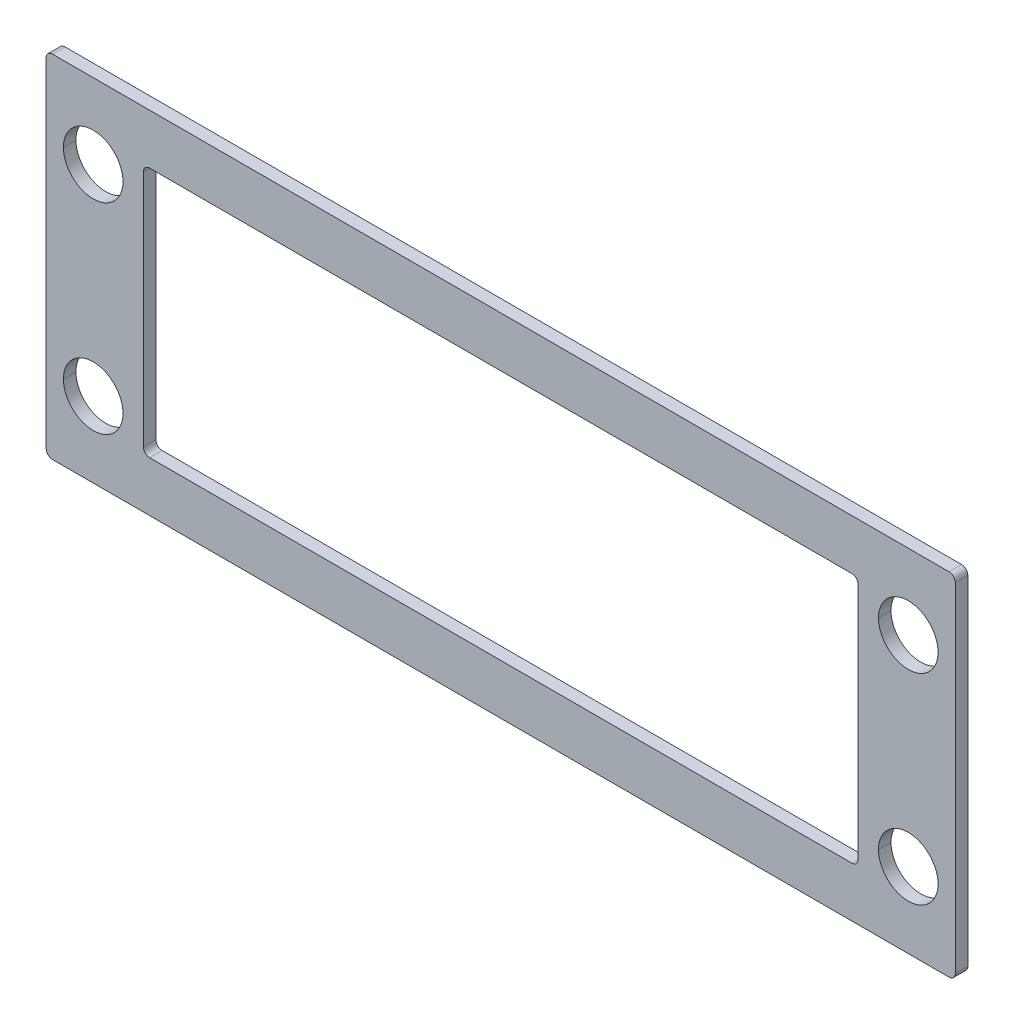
ISO-10303-21;
HEADER;
FILE_DESCRIPTION(('STEP AP214'),'2;1');
FILE_NAME('part.step','',(''),(''),'','','');
FILE_SCHEMA(('AUTOMOTIVE_DESIGN { 1 0 10303 214 1 1 1 1 }'));
ENDSEC;
DATA;
#1=APPLICATION_CONTEXT('core data for automotive mechanical design processes');
#2=APPLICATION_PROTOCOL_DEFINITION('international standard','automotive_design',2000,#1);
#3=PRODUCT_CONTEXT('',#1,'mechanical');
#4=PRODUCT('Part','Part','',(#3));
#5=PRODUCT_RELATED_PRODUCT_CATEGORY('part','',(#4));
#6=PRODUCT_DEFINITION_FORMATION('','',#4);
#7=PRODUCT_DEFINITION_CONTEXT('part definition',#1,'design');
#8=PRODUCT_DEFINITION('design','',#6,#7);
#9=PRODUCT_DEFINITION_SHAPE('','',#8);
#10=(LENGTH_UNIT() NAMED_UNIT(*) SI_UNIT(.MILLI.,.METRE.));
#11=(NAMED_UNIT(*) PLANE_ANGLE_UNIT() SI_UNIT($,.RADIAN.));
#12=(NAMED_UNIT(*) SI_UNIT($,.STERADIAN.) SOLID_ANGLE_UNIT());
#13=UNCERTAINTY_MEASURE_WITH_UNIT(LENGTH_MEASURE(1.E-05),#10,'distance_accuracy_value','');
#14=(GEOMETRIC_REPRESENTATION_CONTEXT(3) GLOBAL_UNCERTAINTY_ASSIGNED_CONTEXT((#13)) GLOBAL_UNIT_ASSIGNED_CONTEXT((#10,
#11,#12)) REPRESENTATION_CONTEXT('',''));
#15=CARTESIAN_POINT('',(0.,0.,0.));
#16=DIRECTION('',(0.,0.,1.));
#17=DIRECTION('',(1.,0.,0.));
#18=AXIS2_PLACEMENT_3D('',#15,#16,#17);
#19=CARTESIAN_POINT('',(65.,-6.5,4.93502884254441));
#20=DIRECTION('',(0.,0.,-1.));
#21=DIRECTION('',(-1.,0.,0.));
#22=AXIS2_PLACEMENT_3D('',#19,#20,#21);
#23=CYLINDRICAL_SURFACE('',#22,4.75);
#24=DIRECTION('',(0.,0.,-1.));
#25=VECTOR('',#24,1.);
#26=CARTESIAN_POINT('',(69.75,-6.5,4.93502884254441));
#27=LINE('',#26,#25);
#28=CARTESIAN_POINT('',(69.75,-6.5,-8.5));
#29=VERTEX_POINT('',#28);
#30=CARTESIAN_POINT('',(69.75,-6.5,-10.5));
#31=VERTEX_POINT('',#30);
#32=EDGE_CURVE('E438',#29,#31,#27,.T.);
#33=ORIENTED_EDGE('',*,*,#32,.F.);
#34=CARTESIAN_POINT('',(65.,-6.5,-8.5));
#35=DIRECTION('',(0.,0.,-1.));
#36=DIRECTION('',(-1.,0.,0.));
#37=AXIS2_PLACEMENT_3D('',#34,#35,#36);
#38=CIRCLE('',#37,4.75);
#39=CARTESIAN_POINT('',(60.25,-6.5,-8.5));
#40=VERTEX_POINT('',#39);
#41=EDGE_CURVE('E271',#40,#29,#38,.T.);
#42=ORIENTED_EDGE('',*,*,#41,.F.);
#43=DIRECTION('',(0.,0.,-1.));
#44=VECTOR('',#43,1.);
#45=CARTESIAN_POINT('',(60.25,-6.5,4.93502884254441));
#46=LINE('',#45,#44);
#47=CARTESIAN_POINT('',(60.25,-6.5,-10.5));
#48=VERTEX_POINT('',#47);
#49=EDGE_CURVE('E418',#40,#48,#46,.T.);
#50=ORIENTED_EDGE('',*,*,#49,.T.);
#51=CARTESIAN_POINT('',(65.,-6.5,-10.5));
#52=DIRECTION('',(0.,0.,1.));
#53=DIRECTION('',(1.,0.,0.));
#54=AXIS2_PLACEMENT_3D('',#51,#52,#53);
#55=CIRCLE('',#54,4.75);
#56=EDGE_CURVE('E212',#31,#48,#55,.T.);
#57=ORIENTED_EDGE('',*,*,#56,.F.);
#58=EDGE_LOOP('',(#33,#42,#50,#57));
#59=FACE_BOUND('',#58,.T.);
#60=ADVANCED_FACE('F15',(#59),#23,.F.);
#61=CARTESIAN_POINT('',(-65.,-6.5,4.93502884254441));
#62=DIRECTION('',(0.,0.,-1.));
#63=DIRECTION('',(-1.,0.,0.));
#64=AXIS2_PLACEMENT_3D('',#61,#62,#63);
#65=CYLINDRICAL_SURFACE('',#64,4.75);
#66=DIRECTION('',(0.,0.,-1.));
#67=VECTOR('',#66,1.);
#68=CARTESIAN_POINT('',(-60.25,-6.5,4.93502884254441));
#69=LINE('',#68,#67);
#70=CARTESIAN_POINT('',(-60.25,-6.5,-8.5));
#71=VERTEX_POINT('',#70);
#72=CARTESIAN_POINT('',(-60.25,-6.5,-10.5));
#73=VERTEX_POINT('',#72);
#74=EDGE_CURVE('E402',#71,#73,#69,.T.);
#75=ORIENTED_EDGE('',*,*,#74,.F.);
#76=CARTESIAN_POINT('',(-65.,-6.5,-8.5));
#77=DIRECTION('',(0.,0.,-1.));
#78=DIRECTION('',(-1.,0.,0.));
#79=AXIS2_PLACEMENT_3D('',#76,#77,#78);
#80=CIRCLE('',#79,4.75);
#81=CARTESIAN_POINT('',(-69.75,-6.5,-8.5));
#82=VERTEX_POINT('',#81);
#83=EDGE_CURVE('E267',#82,#71,#80,.T.);
#84=ORIENTED_EDGE('',*,*,#83,.F.);
#85=DIRECTION('',(0.,0.,-1.));
#86=VECTOR('',#85,1.);
#87=CARTESIAN_POINT('',(-69.75,-6.5,4.93502884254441));
#88=LINE('',#87,#86);
#89=CARTESIAN_POINT('',(-69.75,-6.5,-10.5));
#90=VERTEX_POINT('',#89);
#91=EDGE_CURVE('E391',#82,#90,#88,.T.);
#92=ORIENTED_EDGE('',*,*,#91,.T.);
#93=CARTESIAN_POINT('',(-65.,-6.5,-10.5));
#94=DIRECTION('',(0.,0.,1.));
#95=DIRECTION('',(1.,0.,0.));
#96=AXIS2_PLACEMENT_3D('',#93,#94,#95);
#97=CIRCLE('',#96,4.75);
#98=EDGE_CURVE('E303',#73,#90,#97,.T.);
#99=ORIENTED_EDGE('',*,*,#98,.F.);
#100=EDGE_LOOP('',(#75,#84,#92,#99));
#101=FACE_BOUND('',#100,.T.);
#102=ADVANCED_FACE('F568',(#101),#65,.F.);
#103=CARTESIAN_POINT('',(71.5,4.5,-8.5));
#104=DIRECTION('',(0.,0.,-1.));
#105=DIRECTION('',(-1.,0.,0.));
#106=AXIS2_PLACEMENT_3D('',#103,#104,#105);
#107=CYLINDRICAL_SURFACE('',#106,1.);
#108=CARTESIAN_POINT('',(71.5,4.5,-8.5));
#109=DIRECTION('',(0.,0.,1.));
#110=DIRECTION('',(-1.,0.,0.));
#111=AXIS2_PLACEMENT_3D('',#108,#109,#110);
#112=CIRCLE('',#111,1.);
#113=CARTESIAN_POINT('',(72.5,4.5,-8.5));
#114=VERTEX_POINT('',#113);
#115=CARTESIAN_POINT('',(71.5,5.5,-8.5));
#116=VERTEX_POINT('',#115);
#117=EDGE_CURVE('E211',#114,#116,#112,.T.);
#118=ORIENTED_EDGE('',*,*,#117,.F.);
#119=DIRECTION('',(0.,0.,1.));
#120=VECTOR('',#119,1.);
#121=CARTESIAN_POINT('',(72.5,4.5,-8.5));
#122=LINE('',#121,#120);
#123=CARTESIAN_POINT('',(72.5,4.5,-10.5));
#124=VERTEX_POINT('',#123);
#125=EDGE_CURVE('E250',#124,#114,#122,.T.);
#126=ORIENTED_EDGE('',*,*,#125,.F.);
#127=CARTESIAN_POINT('',(71.5,4.5,-10.5));
#128=DIRECTION('',(0.,0.,-1.));
#129=DIRECTION('',(-1.,0.,0.));
#130=AXIS2_PLACEMENT_3D('',#127,#128,#129);
#131=CIRCLE('',#130,1.);
#132=CARTESIAN_POINT('',(71.5,5.5,-10.5));
#133=VERTEX_POINT('',#132);
#134=EDGE_CURVE('E289',#133,#124,#131,.T.);
#135=ORIENTED_EDGE('',*,*,#134,.F.);
#136=DIRECTION('',(0.,0.,-1.));
#137=VECTOR('',#136,1.);
#138=CARTESIAN_POINT('',(71.5,5.5,-8.5));
#139=LINE('',#138,#137);
#140=EDGE_CURVE('E249',#116,#133,#139,.T.);
#141=ORIENTED_EDGE('',*,*,#140,.F.);
#142=EDGE_LOOP('',(#118,#126,#135,#141));
#143=FACE_BOUND('',#142,.T.);
#144=ADVANCED_FACE('F549',(#143),#107,.T.);
#145=CARTESIAN_POINT('',(71.5,-49.5,-8.5));
#146=DIRECTION('',(0.,0.,-1.));
#147=DIRECTION('',(-1.,0.,0.));
#148=AXIS2_PLACEMENT_3D('',#145,#146,#147);
#149=CYLINDRICAL_SURFACE('',#148,1.);
#150=CARTESIAN_POINT('',(71.5,-49.5,-8.5));
#151=DIRECTION('',(0.,0.,1.));
#152=DIRECTION('',(-1.,0.,0.));
#153=AXIS2_PLACEMENT_3D('',#150,#151,#152);
#154=CIRCLE('',#153,1.);
#155=CARTESIAN_POINT('',(71.5,-50.5,-8.5));
#156=VERTEX_POINT('',#155);
#157=CARTESIAN_POINT('',(72.5,-49.5,-8.5));
#158=VERTEX_POINT('',#157);
#159=EDGE_CURVE('E177',#156,#158,#154,.T.);
#160=ORIENTED_EDGE('',*,*,#159,.F.);
#161=DIRECTION('',(0.,0.,1.));
#162=VECTOR('',#161,1.);
#163=CARTESIAN_POINT('',(71.5,-50.5,-8.5));
#164=LINE('',#163,#162);
#165=CARTESIAN_POINT('',(71.5,-50.5,-10.5));
#166=VERTEX_POINT('',#165);
#167=EDGE_CURVE('E162',#166,#156,#164,.T.);
#168=ORIENTED_EDGE('',*,*,#167,.F.);
#169=CARTESIAN_POINT('',(71.5,-49.5,-10.5));
#170=DIRECTION('',(0.,0.,-1.));
#171=DIRECTION('',(-1.,0.,0.));
#172=AXIS2_PLACEMENT_3D('',#169,#170,#171);
#173=CIRCLE('',#172,1.);
#174=CARTESIAN_POINT('',(72.5,-49.5,-10.5));
#175=VERTEX_POINT('',#174);
#176=EDGE_CURVE('E294',#175,#166,#173,.T.);
#177=ORIENTED_EDGE('',*,*,#176,.F.);
#178=DIRECTION('',(0.,0.,-1.));
#179=VECTOR('',#178,1.);
#180=CARTESIAN_POINT('',(72.5,-49.5,-8.5));
#181=LINE('',#180,#179);
#182=EDGE_CURVE('E174',#158,#175,#181,.T.);
#183=ORIENTED_EDGE('',*,*,#182,.F.);
#184=EDGE_LOOP('',(#160,#168,#177,#183));
#185=FACE_BOUND('',#184,.T.);
#186=ADVANCED_FACE('F178',(#185),#149,.T.);
#187=CARTESIAN_POINT('',(-71.5,-49.5,-8.5));
#188=DIRECTION('',(0.,0.,-1.));
#189=DIRECTION('',(-1.,0.,0.));
#190=AXIS2_PLACEMENT_3D('',#187,#188,#189);
#191=CYLINDRICAL_SURFACE('',#190,1.);
#192=CARTESIAN_POINT('',(-71.5,-49.5,-8.5));
#193=DIRECTION('',(0.,0.,1.));
#194=DIRECTION('',(-1.,0.,0.));
#195=AXIS2_PLACEMENT_3D('',#192,#193,#194);
#196=CIRCLE('',#195,1.);
#197=CARTESIAN_POINT('',(-72.5,-49.5,-8.5));
#198=VERTEX_POINT('',#197);
#199=CARTESIAN_POINT('',(-71.5,-50.5,-8.5));
#200=VERTEX_POINT('',#199);
#201=EDGE_CURVE('E189',#198,#200,#196,.T.);
#202=ORIENTED_EDGE('',*,*,#201,.F.);
#203=DIRECTION('',(0.,0.,1.));
#204=VECTOR('',#203,1.);
#205=CARTESIAN_POINT('',(-72.5,-49.5,-8.5));
#206=LINE('',#205,#204);
#207=CARTESIAN_POINT('',(-72.5,-49.5,-10.5));
#208=VERTEX_POINT('',#207);
#209=EDGE_CURVE('E224',#208,#198,#206,.T.);
#210=ORIENTED_EDGE('',*,*,#209,.F.);
#211=CARTESIAN_POINT('',(-71.5,-49.5,-10.5));
#212=DIRECTION('',(0.,0.,-1.));
#213=DIRECTION('',(-1.,0.,0.));
#214=AXIS2_PLACEMENT_3D('',#211,#212,#213);
#215=CIRCLE('',#214,1.);
#216=CARTESIAN_POINT('',(-71.5,-50.5,-10.5));
#217=VERTEX_POINT('',#216);
#218=EDGE_CURVE('E299',#217,#208,#215,.T.);
#219=ORIENTED_EDGE('',*,*,#218,.F.);
#220=DIRECTION('',(0.,0.,-1.));
#221=VECTOR('',#220,1.);
#222=CARTESIAN_POINT('',(-71.5,-50.5,-8.5));
#223=LINE('',#222,#221);
#224=EDGE_CURVE('E156',#200,#217,#223,.T.);
#225=ORIENTED_EDGE('',*,*,#224,.F.);
#226=EDGE_LOOP('',(#202,#210,#219,#225));
#227=FACE_BOUND('',#226,.T.);
#228=ADVANCED_FACE('F557',(#227),#191,.T.);
#229=CARTESIAN_POINT('',(-71.5,4.5,-8.5));
#230=DIRECTION('',(0.,0.,-1.));
#231=DIRECTION('',(-1.,0.,0.));
#232=AXIS2_PLACEMENT_3D('',#229,#230,#231);
#233=CYLINDRICAL_SURFACE('',#232,1.);
#234=CARTESIAN_POINT('',(-71.5,4.5,-8.5));
#235=DIRECTION('',(0.,0.,1.));
#236=DIRECTION('',(-1.,0.,0.));
#237=AXIS2_PLACEMENT_3D('',#234,#235,#236);
#238=CIRCLE('',#237,1.);
#239=CARTESIAN_POINT('',(-71.5,5.5,-8.5));
#240=VERTEX_POINT('',#239);
#241=CARTESIAN_POINT('',(-72.5,4.5,-8.5));
#242=VERTEX_POINT('',#241);
#243=EDGE_CURVE('E360',#240,#242,#238,.T.);
#244=ORIENTED_EDGE('',*,*,#243,.F.);
#245=DIRECTION('',(0.,0.,1.));
#246=VECTOR('',#245,1.);
#247=CARTESIAN_POINT('',(-71.5,5.5,-8.5));
#248=LINE('',#247,#246);
#249=CARTESIAN_POINT('',(-71.5,5.5,-10.5));
#250=VERTEX_POINT('',#249);
#251=EDGE_CURVE('E245',#250,#240,#248,.T.);
#252=ORIENTED_EDGE('',*,*,#251,.F.);
#253=CARTESIAN_POINT('',(-71.5,4.5,-10.5));
#254=DIRECTION('',(0.,0.,-1.));
#255=DIRECTION('',(-1.,0.,0.));
#256=AXIS2_PLACEMENT_3D('',#253,#254,#255);
#257=CIRCLE('',#256,1.);
#258=CARTESIAN_POINT('',(-72.5,4.5,-10.5));
#259=VERTEX_POINT('',#258);
#260=EDGE_CURVE('E281',#259,#250,#257,.T.);
#261=ORIENTED_EDGE('',*,*,#260,.F.);
#262=DIRECTION('',(0.,0.,-1.));
#263=VECTOR('',#262,1.);
#264=CARTESIAN_POINT('',(-72.5,4.5,-8.5));
#265=LINE('',#264,#263);
#266=EDGE_CURVE('E216',#242,#259,#265,.T.);
#267=ORIENTED_EDGE('',*,*,#266,.F.);
#268=EDGE_LOOP('',(#244,#252,#261,#267));
#269=FACE_BOUND('',#268,.T.);
#270=ADVANCED_FACE('F547',(#269),#233,.T.);
#271=CARTESIAN_POINT('',(-56.,-41.5,112.313906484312));
#272=DIRECTION('',(0.,0.,1.));
#273=DIRECTION('',(1.,0.,0.));
#274=AXIS2_PLACEMENT_3D('',#271,#272,#273);
#275=CYLINDRICAL_SURFACE('',#274,1.);
#276=CARTESIAN_POINT('',(-56.,-41.5,-8.5));
#277=DIRECTION('',(0.,0.,-1.));
#278=DIRECTION('',(-1.,0.,0.));
#279=AXIS2_PLACEMENT_3D('',#276,#277,#278);
#280=CIRCLE('',#279,1.);
#281=CARTESIAN_POINT('',(-56.,-42.5,-8.5));
#282=VERTEX_POINT('',#281);
#283=CARTESIAN_POINT('',(-57.,-41.5,-8.5));
#284=VERTEX_POINT('',#283);
#285=EDGE_CURVE('E243',#282,#284,#280,.T.);
#286=ORIENTED_EDGE('',*,*,#285,.F.);
#287=DIRECTION('',(0.,0.,1.));
#288=VECTOR('',#287,1.);
#289=CARTESIAN_POINT('',(-56.,-42.5,-8.5));
#290=LINE('',#289,#288);
#291=CARTESIAN_POINT('',(-56.,-42.5,-10.5));
#292=VERTEX_POINT('',#291);
#293=EDGE_CURVE('E327',#292,#282,#290,.T.);
#294=ORIENTED_EDGE('',*,*,#293,.F.);
#295=CARTESIAN_POINT('',(-56.,-41.5,-10.5));
#296=DIRECTION('',(0.,0.,1.));
#297=DIRECTION('',(-1.,0.,0.));
#298=AXIS2_PLACEMENT_3D('',#295,#296,#297);
#299=CIRCLE('',#298,1.);
#300=CARTESIAN_POINT('',(-57.,-41.5,-10.5));
#301=VERTEX_POINT('',#300);
#302=EDGE_CURVE('E203',#301,#292,#299,.T.);
#303=ORIENTED_EDGE('',*,*,#302,.F.);
#304=DIRECTION('',(0.,0.,-1.));
#305=VECTOR('',#304,1.);
#306=CARTESIAN_POINT('',(-57.,-41.5,-10.5));
#307=LINE('',#306,#305);
#308=EDGE_CURVE('E10',#284,#301,#307,.T.);
#309=ORIENTED_EDGE('',*,*,#308,.F.);
#310=EDGE_LOOP('',(#286,#294,#303,#309));
#311=FACE_BOUND('',#310,.T.);
#312=ADVANCED_FACE('F342',(#311),#275,.F.);
#313=CARTESIAN_POINT('',(-56.,-3.5,112.313906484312));
#314=DIRECTION('',(0.,0.,1.));
#315=DIRECTION('',(1.,0.,0.));
#316=AXIS2_PLACEMENT_3D('',#313,#314,#315);
#317=CYLINDRICAL_SURFACE('',#316,1.);
#318=CARTESIAN_POINT('',(-56.,-3.5,-8.5));
#319=DIRECTION('',(0.,0.,-1.));
#320=DIRECTION('',(-1.,0.,0.));
#321=AXIS2_PLACEMENT_3D('',#318,#319,#320);
#322=CIRCLE('',#321,1.);
#323=CARTESIAN_POINT('',(-57.,-3.5,-8.5));
#324=VERTEX_POINT('',#323);
#325=CARTESIAN_POINT('',(-56.,-2.5,-8.5));
#326=VERTEX_POINT('',#325);
#327=EDGE_CURVE('E221',#324,#326,#322,.T.);
#328=ORIENTED_EDGE('',*,*,#327,.F.);
#329=DIRECTION('',(0.,0.,1.));
#330=VECTOR('',#329,1.);
#331=CARTESIAN_POINT('',(-57.,-3.5,-8.5));
#332=LINE('',#331,#330);
#333=CARTESIAN_POINT('',(-57.,-3.5,-10.5));
#334=VERTEX_POINT('',#333);
#335=EDGE_CURVE('E24',#334,#324,#332,.T.);
#336=ORIENTED_EDGE('',*,*,#335,.F.);
#337=CARTESIAN_POINT('',(-56.,-3.5,-10.5));
#338=DIRECTION('',(0.,0.,1.));
#339=DIRECTION('',(-1.,0.,0.));
#340=AXIS2_PLACEMENT_3D('',#337,#338,#339);
#341=CIRCLE('',#340,1.);
#342=CARTESIAN_POINT('',(-56.,-2.5,-10.5));
#343=VERTEX_POINT('',#342);
#344=EDGE_CURVE('E200',#343,#334,#341,.T.);
#345=ORIENTED_EDGE('',*,*,#344,.F.);
#346=DIRECTION('',(0.,0.,-1.));
#347=VECTOR('',#346,1.);
#348=CARTESIAN_POINT('',(-56.,-2.5,-10.5));
#349=LINE('',#348,#347);
#350=EDGE_CURVE('E263',#326,#343,#349,.T.);
#351=ORIENTED_EDGE('',*,*,#350,.F.);
#352=EDGE_LOOP('',(#328,#336,#345,#351));
#353=FACE_BOUND('',#352,.T.);
#354=ADVANCED_FACE('F336',(#353),#317,.F.);
#355=CARTESIAN_POINT('',(56.,-3.5,112.313906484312));
#356=DIRECTION('',(0.,0.,1.));
#357=DIRECTION('',(1.,0.,0.));
#358=AXIS2_PLACEMENT_3D('',#355,#356,#357);
#359=CYLINDRICAL_SURFACE('',#358,1.);
#360=CARTESIAN_POINT('',(56.,-3.5,-8.5));
#361=DIRECTION('',(0.,0.,-1.));
#362=DIRECTION('',(-1.,0.,0.));
#363=AXIS2_PLACEMENT_3D('',#360,#361,#362);
#364=CIRCLE('',#363,1.);
#365=CARTESIAN_POINT('',(56.,-2.5,-8.5));
#366=VERTEX_POINT('',#365);
#367=CARTESIAN_POINT('',(57.,-3.5,-8.5));
#368=VERTEX_POINT('',#367);
#369=EDGE_CURVE('E232',#366,#368,#364,.T.);
#370=ORIENTED_EDGE('',*,*,#369,.F.);
#371=DIRECTION('',(0.,0.,1.));
#372=VECTOR('',#371,1.);
#373=CARTESIAN_POINT('',(56.,-2.5,-8.5));
#374=LINE('',#373,#372);
#375=CARTESIAN_POINT('',(56.,-2.5,-10.5));
#376=VERTEX_POINT('',#375);
#377=EDGE_CURVE('E259',#376,#366,#374,.T.);
#378=ORIENTED_EDGE('',*,*,#377,.F.);
#379=CARTESIAN_POINT('',(56.,-3.5,-10.5));
#380=DIRECTION('',(0.,0.,1.));
#381=DIRECTION('',(-1.,0.,0.));
#382=AXIS2_PLACEMENT_3D('',#379,#380,#381);
#383=CIRCLE('',#382,1.);
#384=CARTESIAN_POINT('',(57.,-3.5,-10.5));
#385=VERTEX_POINT('',#384);
#386=EDGE_CURVE('E353',#385,#376,#383,.T.);
#387=ORIENTED_EDGE('',*,*,#386,.F.);
#388=DIRECTION('',(0.,0.,-1.));
#389=VECTOR('',#388,1.);
#390=CARTESIAN_POINT('',(57.,-3.5,-10.5));
#391=LINE('',#390,#389);
#392=EDGE_CURVE('E129',#368,#385,#391,.T.);
#393=ORIENTED_EDGE('',*,*,#392,.F.);
#394=EDGE_LOOP('',(#370,#378,#387,#393));
#395=FACE_BOUND('',#394,.T.);
#396=ADVANCED_FACE('F643',(#395),#359,.F.);
#397=CARTESIAN_POINT('',(56.,-41.5,112.313906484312));
#398=DIRECTION('',(0.,0.,1.));
#399=DIRECTION('',(1.,0.,0.));
#400=AXIS2_PLACEMENT_3D('',#397,#398,#399);
#401=CYLINDRICAL_SURFACE('',#400,1.);
#402=CARTESIAN_POINT('',(56.,-41.5,-8.5));
#403=DIRECTION('',(0.,0.,-1.));
#404=DIRECTION('',(-1.,0.,0.));
#405=AXIS2_PLACEMENT_3D('',#402,#403,#404);
#406=CIRCLE('',#405,1.);
#407=CARTESIAN_POINT('',(57.,-41.5,-8.5));
#408=VERTEX_POINT('',#407);
#409=CARTESIAN_POINT('',(56.,-42.5,-8.5));
#410=VERTEX_POINT('',#409);
#411=EDGE_CURVE('E244',#408,#410,#406,.T.);
#412=ORIENTED_EDGE('',*,*,#411,.F.);
#413=DIRECTION('',(0.,0.,1.));
#414=VECTOR('',#413,1.);
#415=CARTESIAN_POINT('',(57.,-41.5,-8.5));
#416=LINE('',#415,#414);
#417=CARTESIAN_POINT('',(57.,-41.5,-10.5));
#418=VERTEX_POINT('',#417);
#419=EDGE_CURVE('E117',#418,#408,#416,.T.);
#420=ORIENTED_EDGE('',*,*,#419,.F.);
#421=CARTESIAN_POINT('',(56.,-41.5,-10.5));
#422=DIRECTION('',(0.,0.,1.));
#423=DIRECTION('',(-1.,0.,0.));
#424=AXIS2_PLACEMENT_3D('',#421,#422,#423);
#425=CIRCLE('',#424,1.);
#426=CARTESIAN_POINT('',(56.,-42.5,-10.5));
#427=VERTEX_POINT('',#426);
#428=EDGE_CURVE('E312',#427,#418,#425,.T.);
#429=ORIENTED_EDGE('',*,*,#428,.F.);
#430=DIRECTION('',(0.,0.,-1.));
#431=VECTOR('',#430,1.);
#432=CARTESIAN_POINT('',(56.,-42.5,-10.5));
#433=LINE('',#432,#431);
#434=EDGE_CURVE('E110',#410,#427,#433,.T.);
#435=ORIENTED_EDGE('',*,*,#434,.F.);
#436=EDGE_LOOP('',(#412,#420,#429,#435));
#437=FACE_BOUND('',#436,.T.);
#438=ADVANCED_FACE('F640',(#437),#401,.F.);
#439=CARTESIAN_POINT('',(65.,-38.5,112.313906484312));
#440=DIRECTION('',(0.,0.,-1.));
#441=DIRECTION('',(-1.,0.,0.));
#442=AXIS2_PLACEMENT_3D('',#439,#440,#441);
#443=CYLINDRICAL_SURFACE('',#442,4.75);
#444=DIRECTION('',(0.,0.,-1.));
#445=VECTOR('',#444,1.);
#446=CARTESIAN_POINT('',(69.75,-38.5,112.313906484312));
#447=LINE('',#446,#445);
#448=CARTESIAN_POINT('',(69.75,-38.5,-8.5));
#449=VERTEX_POINT('',#448);
#450=CARTESIAN_POINT('',(69.75,-38.5,-10.5));
#451=VERTEX_POINT('',#450);
#452=EDGE_CURVE('E390',#449,#451,#447,.T.);
#453=ORIENTED_EDGE('',*,*,#452,.F.);
#454=CARTESIAN_POINT('',(65.,-38.5,-8.5));
#455=DIRECTION('',(0.,0.,-1.));
#456=DIRECTION('',(-1.,0.,0.));
#457=AXIS2_PLACEMENT_3D('',#454,#455,#456);
#458=CIRCLE('',#457,4.75);
#459=CARTESIAN_POINT('',(60.25,-38.5,-8.5));
#460=VERTEX_POINT('',#459);
#461=EDGE_CURVE('E258',#460,#449,#458,.T.);
#462=ORIENTED_EDGE('',*,*,#461,.F.);
#463=DIRECTION('',(0.,0.,-1.));
#464=VECTOR('',#463,1.);
#465=CARTESIAN_POINT('',(60.25,-38.5,112.313906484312));
#466=LINE('',#465,#464);
#467=CARTESIAN_POINT('',(60.25,-38.5,-10.5));
#468=VERTEX_POINT('',#467);
#469=EDGE_CURVE('E381',#460,#468,#466,.T.);
#470=ORIENTED_EDGE('',*,*,#469,.T.);
#471=CARTESIAN_POINT('',(65.,-38.5,-10.5));
#472=DIRECTION('',(0.,0.,1.));
#473=DIRECTION('',(1.,0.,0.));
#474=AXIS2_PLACEMENT_3D('',#471,#472,#473);
#475=CIRCLE('',#474,4.75);
#476=EDGE_CURVE('E208',#451,#468,#475,.T.);
#477=ORIENTED_EDGE('',*,*,#476,.F.);
#478=EDGE_LOOP('',(#453,#462,#470,#477));
#479=FACE_BOUND('',#478,.T.);
#480=ADVANCED_FACE('F585',(#479),#443,.F.);
#481=CARTESIAN_POINT('',(-65.,-38.5,112.313906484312));
#482=DIRECTION('',(0.,0.,-1.));
#483=DIRECTION('',(-1.,0.,0.));
#484=AXIS2_PLACEMENT_3D('',#481,#482,#483);
#485=CYLINDRICAL_SURFACE('',#484,4.75);
#486=DIRECTION('',(0.,0.,-1.));
#487=VECTOR('',#486,1.);
#488=CARTESIAN_POINT('',(-60.25,-38.5,112.313906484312));
#489=LINE('',#488,#487);
#490=CARTESIAN_POINT('',(-60.25,-38.5,-8.5));
#491=VERTEX_POINT('',#490);
#492=CARTESIAN_POINT('',(-60.25,-38.5,-10.5));
#493=VERTEX_POINT('',#492);
#494=EDGE_CURVE('E380',#491,#493,#489,.T.);
#495=ORIENTED_EDGE('',*,*,#494,.F.);
#496=CARTESIAN_POINT('',(-65.,-38.5,-8.5));
#497=DIRECTION('',(0.,0.,-1.));
#498=DIRECTION('',(-1.,0.,0.));
#499=AXIS2_PLACEMENT_3D('',#496,#497,#498);
#500=CIRCLE('',#499,4.75);
#501=CARTESIAN_POINT('',(-69.75,-38.5,-8.5));
#502=VERTEX_POINT('',#501);
#503=EDGE_CURVE('E254',#502,#491,#500,.T.);
#504=ORIENTED_EDGE('',*,*,#503,.F.);
#505=DIRECTION('',(0.,0.,-1.));
#506=VECTOR('',#505,1.);
#507=CARTESIAN_POINT('',(-69.75,-38.5,112.313906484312));
#508=LINE('',#507,#506);
#509=CARTESIAN_POINT('',(-69.75,-38.5,-10.5));
#510=VERTEX_POINT('',#509);
#511=EDGE_CURVE('E371',#502,#510,#508,.T.);
#512=ORIENTED_EDGE('',*,*,#511,.T.);
#513=CARTESIAN_POINT('',(-65.,-38.5,-10.5));
#514=DIRECTION('',(0.,0.,1.));
#515=DIRECTION('',(1.,0.,0.));
#516=AXIS2_PLACEMENT_3D('',#513,#514,#515);
#517=CIRCLE('',#516,4.75);
#518=EDGE_CURVE('E307',#493,#510,#517,.T.);
#519=ORIENTED_EDGE('',*,*,#518,.F.);
#520=EDGE_LOOP('',(#495,#504,#512,#519));
#521=FACE_BOUND('',#520,.T.);
#522=ADVANCED_FACE('F595',(#521),#485,.F.);
#523=CARTESIAN_POINT('',(-57.,-42.5,112.313906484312));
#524=DIRECTION('',(1.,0.,0.));
#525=DIRECTION('',(0.,1.,0.));
#526=AXIS2_PLACEMENT_3D('',#523,#524,#525);
#527=PLANE('',#526);
#528=DIRECTION('',(0.,-1.,0.));
#529=VECTOR('',#528,1.);
#530=CARTESIAN_POINT('',(-57.,-42.5,-10.5));
#531=LINE('',#530,#529);
#532=EDGE_CURVE('E201',#334,#301,#531,.T.);
#533=ORIENTED_EDGE('',*,*,#532,.F.);
#534=ORIENTED_EDGE('',*,*,#335,.T.);
#535=DIRECTION('',(0.,1.,0.));
#536=VECTOR('',#535,1.);
#537=CARTESIAN_POINT('',(-57.,-42.5,-8.5));
#538=LINE('',#537,#536);
#539=EDGE_CURVE('E217',#284,#324,#538,.T.);
#540=ORIENTED_EDGE('',*,*,#539,.F.);
#541=ORIENTED_EDGE('',*,*,#308,.T.);
#542=EDGE_LOOP('',(#533,#534,#540,#541));
#543=FACE_BOUND('',#542,.T.);
#544=ADVANCED_FACE('F332',(#543),#527,.T.);
#545=CARTESIAN_POINT('',(-57.,-42.5,112.313906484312));
#546=DIRECTION('',(0.,1.,0.));
#547=DIRECTION('',(1.,0.,0.));
#548=AXIS2_PLACEMENT_3D('',#545,#546,#547);
#549=PLANE('',#548);
#550=DIRECTION('',(-1.,0.,0.));
#551=VECTOR('',#550,1.);
#552=CARTESIAN_POINT('',(-57.,-42.5,-8.5));
#553=LINE('',#552,#551);
#554=EDGE_CURVE('E239',#410,#282,#553,.T.);
#555=ORIENTED_EDGE('',*,*,#554,.F.);
#556=ORIENTED_EDGE('',*,*,#434,.T.);
#557=DIRECTION('',(1.,0.,0.));
#558=VECTOR('',#557,1.);
#559=CARTESIAN_POINT('',(-57.,-42.5,-10.5));
#560=LINE('',#559,#558);
#561=EDGE_CURVE('E311',#292,#427,#560,.T.);
#562=ORIENTED_EDGE('',*,*,#561,.F.);
#563=ORIENTED_EDGE('',*,*,#293,.T.);
#564=EDGE_LOOP('',(#555,#556,#562,#563));
#565=FACE_BOUND('',#564,.T.);
#566=ADVANCED_FACE('F618',(#565),#549,.T.);
#567=CARTESIAN_POINT('',(57.,-42.5,112.313906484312));
#568=DIRECTION('',(-1.,0.,0.));
#569=DIRECTION('',(0.,0.,1.));
#570=AXIS2_PLACEMENT_3D('',#567,#568,#569);
#571=PLANE('',#570);
#572=DIRECTION('',(0.,1.,0.));
#573=VECTOR('',#572,1.);
#574=CARTESIAN_POINT('',(57.,-42.5,-10.5));
#575=LINE('',#574,#573);
#576=EDGE_CURVE('E316',#418,#385,#575,.T.);
#577=ORIENTED_EDGE('',*,*,#576,.F.);
#578=ORIENTED_EDGE('',*,*,#419,.T.);
#579=DIRECTION('',(0.,-1.,0.));
#580=VECTOR('',#579,1.);
#581=CARTESIAN_POINT('',(57.,-42.5,-8.5));
#582=LINE('',#581,#580);
#583=EDGE_CURVE('E238',#368,#408,#582,.T.);
#584=ORIENTED_EDGE('',*,*,#583,.F.);
#585=ORIENTED_EDGE('',*,*,#392,.T.);
#586=EDGE_LOOP('',(#577,#578,#584,#585));
#587=FACE_BOUND('',#586,.T.);
#588=ADVANCED_FACE('F621',(#587),#571,.T.);
#589=CARTESIAN_POINT('',(-57.,-2.5,112.313906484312));
#590=DIRECTION('',(0.,-1.,0.));
#591=DIRECTION('',(0.,0.,-1.));
#592=AXIS2_PLACEMENT_3D('',#589,#590,#591);
#593=PLANE('',#592);
#594=DIRECTION('',(-1.,0.,0.));
#595=VECTOR('',#594,1.);
#596=CARTESIAN_POINT('',(-57.,-2.5,-10.5));
#597=LINE('',#596,#595);
#598=EDGE_CURVE('E350',#376,#343,#597,.T.);
#599=ORIENTED_EDGE('',*,*,#598,.F.);
#600=ORIENTED_EDGE('',*,*,#377,.T.);
#601=DIRECTION('',(1.,0.,0.));
#602=VECTOR('',#601,1.);
#603=CARTESIAN_POINT('',(-57.,-2.5,-8.5));
#604=LINE('',#603,#602);
#605=EDGE_CURVE('E228',#326,#366,#604,.T.);
#606=ORIENTED_EDGE('',*,*,#605,.F.);
#607=ORIENTED_EDGE('',*,*,#350,.T.);
#608=EDGE_LOOP('',(#599,#600,#606,#607));
#609=FACE_BOUND('',#608,.T.);
#610=ADVANCED_FACE('F622',(#609),#593,.T.);
#611=CARTESIAN_POINT('',(-72.5,5.5,-8.5));
#612=DIRECTION('',(0.,-1.,0.));
#613=DIRECTION('',(0.,0.,-1.));
#614=AXIS2_PLACEMENT_3D('',#611,#612,#613);
#615=PLANE('',#614);
#616=DIRECTION('',(-1.,0.,0.));
#617=VECTOR('',#616,1.);
#618=CARTESIAN_POINT('',(-72.5,5.5,-10.5));
#619=LINE('',#618,#617);
#620=EDGE_CURVE('E285',#133,#250,#619,.T.);
#621=ORIENTED_EDGE('',*,*,#620,.T.);
#622=ORIENTED_EDGE('',*,*,#251,.T.);
#623=DIRECTION('',(-1.,0.,0.));
#624=VECTOR('',#623,1.);
#625=CARTESIAN_POINT('',(-72.5,5.5,-8.5));
#626=LINE('',#625,#624);
#627=EDGE_CURVE('E365',#116,#240,#626,.T.);
#628=ORIENTED_EDGE('',*,*,#627,.F.);
#629=ORIENTED_EDGE('',*,*,#140,.T.);
#630=EDGE_LOOP('',(#621,#622,#628,#629));
#631=FACE_BOUND('',#630,.T.);
#632=ADVANCED_FACE('F543',(#631),#615,.F.);
#633=CARTESIAN_POINT('',(72.5,-50.5,-8.5));
#634=DIRECTION('',(-1.,0.,0.));
#635=DIRECTION('',(0.,0.,1.));
#636=AXIS2_PLACEMENT_3D('',#633,#634,#635);
#637=PLANE('',#636);
#638=DIRECTION('',(0.,1.,0.));
#639=VECTOR('',#638,1.);
#640=CARTESIAN_POINT('',(72.5,-50.5,-8.5));
#641=LINE('',#640,#639);
#642=EDGE_CURVE('E184',#158,#114,#641,.T.);
#643=ORIENTED_EDGE('',*,*,#642,.F.);
#644=ORIENTED_EDGE('',*,*,#182,.T.);
#645=DIRECTION('',(0.,1.,0.));
#646=VECTOR('',#645,1.);
#647=CARTESIAN_POINT('',(72.5,-50.5,-10.5));
#648=LINE('',#647,#646);
#649=EDGE_CURVE('E290',#175,#124,#648,.T.);
#650=ORIENTED_EDGE('',*,*,#649,.T.);
#651=ORIENTED_EDGE('',*,*,#125,.T.);
#652=EDGE_LOOP('',(#643,#644,#650,#651));
#653=FACE_BOUND('',#652,.T.);
#654=ADVANCED_FACE('F552',(#653),#637,.F.);
#655=CARTESIAN_POINT('',(-72.5,-50.5,-8.5));
#656=DIRECTION('',(0.,1.,0.));
#657=DIRECTION('',(1.,0.,0.));
#658=AXIS2_PLACEMENT_3D('',#655,#656,#657);
#659=PLANE('',#658);
#660=DIRECTION('',(1.,0.,0.));
#661=VECTOR('',#660,1.);
#662=CARTESIAN_POINT('',(-72.5,-50.5,-8.5));
#663=LINE('',#662,#661);
#664=EDGE_CURVE('E166',#200,#156,#663,.T.);
#665=ORIENTED_EDGE('',*,*,#664,.F.);
#666=ORIENTED_EDGE('',*,*,#224,.T.);
#667=DIRECTION('',(1.,0.,0.));
#668=VECTOR('',#667,1.);
#669=CARTESIAN_POINT('',(-72.5,-50.5,-10.5));
#670=LINE('',#669,#668);
#671=EDGE_CURVE('E169',#217,#166,#670,.T.);
#672=ORIENTED_EDGE('',*,*,#671,.T.);
#673=ORIENTED_EDGE('',*,*,#167,.T.);
#674=EDGE_LOOP('',(#665,#666,#672,#673));
#675=FACE_BOUND('',#674,.T.);
#676=ADVANCED_FACE('F164',(#675),#659,.F.);
#677=CARTESIAN_POINT('',(-72.5,-50.5,-8.5));
#678=DIRECTION('',(1.,0.,0.));
#679=DIRECTION('',(0.,1.,0.));
#680=AXIS2_PLACEMENT_3D('',#677,#678,#679);
#681=PLANE('',#680);
#682=DIRECTION('',(0.,-1.,0.));
#683=VECTOR('',#682,1.);
#684=CARTESIAN_POINT('',(-72.5,-50.5,-8.5));
#685=LINE('',#684,#683);
#686=EDGE_CURVE('E196',#242,#198,#685,.T.);
#687=ORIENTED_EDGE('',*,*,#686,.F.);
#688=ORIENTED_EDGE('',*,*,#266,.T.);
#689=DIRECTION('',(0.,-1.,0.));
#690=VECTOR('',#689,1.);
#691=CARTESIAN_POINT('',(-72.5,-50.5,-10.5));
#692=LINE('',#691,#690);
#693=EDGE_CURVE('E277',#259,#208,#692,.T.);
#694=ORIENTED_EDGE('',*,*,#693,.T.);
#695=ORIENTED_EDGE('',*,*,#209,.T.);
#696=EDGE_LOOP('',(#687,#688,#694,#695));
#697=FACE_BOUND('',#696,.T.);
#698=ADVANCED_FACE('F556',(#697),#681,.F.);
#699=CARTESIAN_POINT('',(-72.5,5.5,-10.5));
#700=DIRECTION('',(0.,0.,-1.));
#701=DIRECTION('',(0.,-1.,0.));
#702=AXIS2_PLACEMENT_3D('',#699,#700,#701);
#703=PLANE('',#702);
#704=CARTESIAN_POINT('',(65.,-6.5,-10.5));
#705=DIRECTION('',(0.,0.,1.));
#706=DIRECTION('',(1.,0.,0.));
#707=AXIS2_PLACEMENT_3D('',#704,#705,#706);
#708=CIRCLE('',#707,4.75);
#709=EDGE_CURVE('E428',#48,#31,#708,.T.);
#710=ORIENTED_EDGE('',*,*,#709,.T.);
#711=ORIENTED_EDGE('',*,*,#56,.T.);
#712=EDGE_LOOP('',(#710,#711));
#713=FACE_BOUND('',#712,.T.);
#714=CARTESIAN_POINT('',(65.,-38.5,-10.5));
#715=DIRECTION('',(0.,0.,1.));
#716=DIRECTION('',(1.,0.,0.));
#717=AXIS2_PLACEMENT_3D('',#714,#715,#716);
#718=CIRCLE('',#717,4.75);
#719=EDGE_CURVE('E385',#468,#451,#718,.T.);
#720=ORIENTED_EDGE('',*,*,#719,.T.);
#721=ORIENTED_EDGE('',*,*,#476,.T.);
#722=EDGE_LOOP('',(#720,#721));
#723=FACE_BOUND('',#722,.T.);
#724=ORIENTED_EDGE('',*,*,#561,.T.);
#725=ORIENTED_EDGE('',*,*,#428,.T.);
#726=ORIENTED_EDGE('',*,*,#576,.T.);
#727=ORIENTED_EDGE('',*,*,#386,.T.);
#728=ORIENTED_EDGE('',*,*,#598,.T.);
#729=ORIENTED_EDGE('',*,*,#344,.T.);
#730=ORIENTED_EDGE('',*,*,#532,.T.);
#731=ORIENTED_EDGE('',*,*,#302,.T.);
#732=EDGE_LOOP('',(#724,#725,#726,#727,#728,#729,#730,#731));
#733=FACE_BOUND('',#732,.T.);
#734=CARTESIAN_POINT('',(-65.,-38.5,-10.5));
#735=DIRECTION('',(0.,0.,1.));
#736=DIRECTION('',(1.,0.,0.));
#737=AXIS2_PLACEMENT_3D('',#734,#735,#736);
#738=CIRCLE('',#737,4.75);
#739=EDGE_CURVE('E375',#510,#493,#738,.T.);
#740=ORIENTED_EDGE('',*,*,#739,.T.);
#741=ORIENTED_EDGE('',*,*,#518,.T.);
#742=EDGE_LOOP('',(#740,#741));
#743=FACE_BOUND('',#742,.T.);
#744=CARTESIAN_POINT('',(-65.,-6.5,-10.5));
#745=DIRECTION('',(0.,0.,1.));
#746=DIRECTION('',(1.,0.,0.));
#747=AXIS2_PLACEMENT_3D('',#744,#745,#746);
#748=CIRCLE('',#747,4.75);
#749=EDGE_CURVE('E395',#90,#73,#748,.T.);
#750=ORIENTED_EDGE('',*,*,#749,.T.);
#751=ORIENTED_EDGE('',*,*,#98,.T.);
#752=EDGE_LOOP('',(#750,#751));
#753=FACE_BOUND('',#752,.T.);
#754=ORIENTED_EDGE('',*,*,#693,.F.);
#755=ORIENTED_EDGE('',*,*,#260,.T.);
#756=ORIENTED_EDGE('',*,*,#620,.F.);
#757=ORIENTED_EDGE('',*,*,#134,.T.);
#758=ORIENTED_EDGE('',*,*,#649,.F.);
#759=ORIENTED_EDGE('',*,*,#176,.T.);
#760=ORIENTED_EDGE('',*,*,#671,.F.);
#761=ORIENTED_EDGE('',*,*,#218,.T.);
#762=EDGE_LOOP('',(#754,#755,#756,#757,#758,#759,#760,#761));
#763=FACE_BOUND('',#762,.T.);
#764=ADVANCED_FACE('F345',(#713,#723,#733,#743,#753,#763),#703,.T.);
#765=CARTESIAN_POINT('',(-72.5,5.5,-8.5));
#766=DIRECTION('',(0.,0.,-1.));
#767=DIRECTION('',(0.,-1.,0.));
#768=AXIS2_PLACEMENT_3D('',#765,#766,#767);
#769=PLANE('',#768);
#770=ORIENTED_EDGE('',*,*,#41,.T.);
#771=CARTESIAN_POINT('',(65.,-6.5,-8.5));
#772=DIRECTION('',(0.,0.,-1.));
#773=DIRECTION('',(-1.,0.,0.));
#774=AXIS2_PLACEMENT_3D('',#771,#772,#773);
#775=CIRCLE('',#774,4.75);
#776=EDGE_CURVE('E451',#29,#40,#775,.T.);
#777=ORIENTED_EDGE('',*,*,#776,.T.);
#778=EDGE_LOOP('',(#770,#777));
#779=FACE_BOUND('',#778,.T.);
#780=ORIENTED_EDGE('',*,*,#83,.T.);
#781=CARTESIAN_POINT('',(-65.,-6.5,-8.5));
#782=DIRECTION('',(0.,0.,-1.));
#783=DIRECTION('',(-1.,0.,0.));
#784=AXIS2_PLACEMENT_3D('',#781,#782,#783);
#785=CIRCLE('',#784,4.75);
#786=EDGE_CURVE('E411',#71,#82,#785,.T.);
#787=ORIENTED_EDGE('',*,*,#786,.T.);
#788=EDGE_LOOP('',(#780,#787));
#789=FACE_BOUND('',#788,.T.);
#790=ORIENTED_EDGE('',*,*,#461,.T.);
#791=CARTESIAN_POINT('',(65.,-38.5,-8.5));
#792=DIRECTION('',(0.,0.,-1.));
#793=DIRECTION('',(-1.,0.,0.));
#794=AXIS2_PLACEMENT_3D('',#791,#792,#793);
#795=CIRCLE('',#794,4.75);
#796=EDGE_CURVE('E386',#449,#460,#795,.T.);
#797=ORIENTED_EDGE('',*,*,#796,.T.);
#798=EDGE_LOOP('',(#790,#797));
#799=FACE_BOUND('',#798,.T.);
#800=ORIENTED_EDGE('',*,*,#503,.T.);
#801=CARTESIAN_POINT('',(-65.,-38.5,-8.5));
#802=DIRECTION('',(0.,0.,-1.));
#803=DIRECTION('',(-1.,0.,0.));
#804=AXIS2_PLACEMENT_3D('',#801,#802,#803);
#805=CIRCLE('',#804,4.75);
#806=EDGE_CURVE('E376',#491,#502,#805,.T.);
#807=ORIENTED_EDGE('',*,*,#806,.T.);
#808=EDGE_LOOP('',(#800,#807));
#809=FACE_BOUND('',#808,.T.);
#810=ORIENTED_EDGE('',*,*,#539,.T.);
#811=ORIENTED_EDGE('',*,*,#327,.T.);
#812=ORIENTED_EDGE('',*,*,#605,.T.);
#813=ORIENTED_EDGE('',*,*,#369,.T.);
#814=ORIENTED_EDGE('',*,*,#583,.T.);
#815=ORIENTED_EDGE('',*,*,#411,.T.);
#816=ORIENTED_EDGE('',*,*,#554,.T.);
#817=ORIENTED_EDGE('',*,*,#285,.T.);
#818=EDGE_LOOP('',(#810,#811,#812,#813,#814,#815,#816,#817));
#819=FACE_BOUND('',#818,.T.);
#820=ORIENTED_EDGE('',*,*,#627,.T.);
#821=ORIENTED_EDGE('',*,*,#243,.T.);
#822=ORIENTED_EDGE('',*,*,#686,.T.);
#823=ORIENTED_EDGE('',*,*,#201,.T.);
#824=ORIENTED_EDGE('',*,*,#664,.T.);
#825=ORIENTED_EDGE('',*,*,#159,.T.);
#826=ORIENTED_EDGE('',*,*,#642,.T.);
#827=ORIENTED_EDGE('',*,*,#117,.T.);
#828=EDGE_LOOP('',(#820,#821,#822,#823,#824,#825,#826,#827));
#829=FACE_BOUND('',#828,.T.);
#830=ADVANCED_FACE('F187',(#779,#789,#799,#809,#819,#829),#769,.F.);
#831=CARTESIAN_POINT('',(-65.,-38.5,112.313906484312));
#832=DIRECTION('',(0.,0.,-1.));
#833=DIRECTION('',(-1.,0.,0.));
#834=AXIS2_PLACEMENT_3D('',#831,#832,#833);
#835=CYLINDRICAL_SURFACE('',#834,4.75);
#836=ORIENTED_EDGE('',*,*,#806,.F.);
#837=ORIENTED_EDGE('',*,*,#494,.T.);
#838=ORIENTED_EDGE('',*,*,#739,.F.);
#839=ORIENTED_EDGE('',*,*,#511,.F.);
#840=EDGE_LOOP('',(#836,#837,#838,#839));
#841=FACE_BOUND('',#840,.T.);
#842=ADVANCED_FACE('F589',(#841),#835,.F.);
#843=CARTESIAN_POINT('',(65.,-38.5,112.313906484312));
#844=DIRECTION('',(0.,0.,-1.));
#845=DIRECTION('',(-1.,0.,0.));
#846=AXIS2_PLACEMENT_3D('',#843,#844,#845);
#847=CYLINDRICAL_SURFACE('',#846,4.75);
#848=ORIENTED_EDGE('',*,*,#796,.F.);
#849=ORIENTED_EDGE('',*,*,#452,.T.);
#850=ORIENTED_EDGE('',*,*,#719,.F.);
#851=ORIENTED_EDGE('',*,*,#469,.F.);
#852=EDGE_LOOP('',(#848,#849,#850,#851));
#853=FACE_BOUND('',#852,.T.);
#854=ADVANCED_FACE('F583',(#853),#847,.F.);
#855=CARTESIAN_POINT('',(-65.,-6.5,4.93502884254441));
#856=DIRECTION('',(0.,0.,-1.));
#857=DIRECTION('',(-1.,0.,0.));
#858=AXIS2_PLACEMENT_3D('',#855,#856,#857);
#859=CYLINDRICAL_SURFACE('',#858,4.75);
#860=ORIENTED_EDGE('',*,*,#786,.F.);
#861=ORIENTED_EDGE('',*,*,#74,.T.);
#862=ORIENTED_EDGE('',*,*,#749,.F.);
#863=ORIENTED_EDGE('',*,*,#91,.F.);
#864=EDGE_LOOP('',(#860,#861,#862,#863));
#865=FACE_BOUND('',#864,.T.);
#866=ADVANCED_FACE('F604',(#865),#859,.F.);
#867=CARTESIAN_POINT('',(65.,-6.5,4.93502884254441));
#868=DIRECTION('',(0.,0.,-1.));
#869=DIRECTION('',(-1.,0.,0.));
#870=AXIS2_PLACEMENT_3D('',#867,#868,#869);
#871=CYLINDRICAL_SURFACE('',#870,4.75);
#872=ORIENTED_EDGE('',*,*,#776,.F.);
#873=ORIENTED_EDGE('',*,*,#32,.T.);
#874=ORIENTED_EDGE('',*,*,#709,.F.);
#875=ORIENTED_EDGE('',*,*,#49,.F.);
#876=EDGE_LOOP('',(#872,#873,#874,#875));
#877=FACE_BOUND('',#876,.T.);
#878=ADVANCED_FACE('F467',(#877),#871,.F.);
#879=CLOSED_SHELL('',(#60,#102,#144,#186,#228,#270,#312,#354,#396,#438,#480,#522,#544,#566,#588,
#610,#632,#654,#676,#698,#764,#830,#842,#854,#866,#878));
#880=MANIFOLD_SOLID_BREP('B1',#879);
#881=ADVANCED_BREP_SHAPE_REPRESENTATION('',(#18,#880),#14);
#882=SHAPE_DEFINITION_REPRESENTATION(#9,#881);
ENDSEC;
END-ISO-10303-21;
